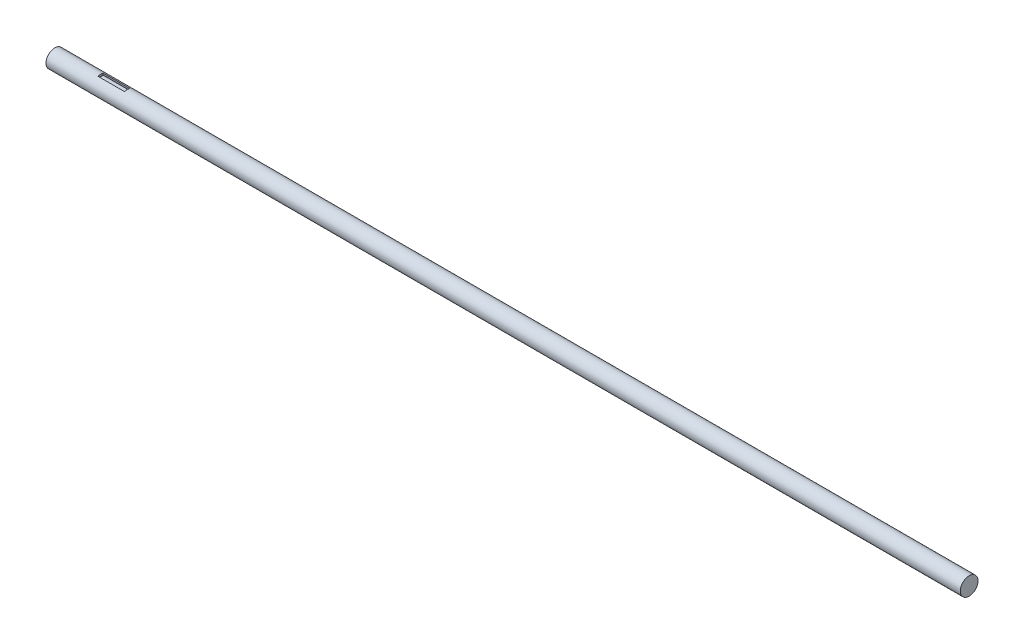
from build123d import *

# Parameters (mm, degrees)
SKETCH1_R           = 30
BOSS_EXTRUDE1_DEPTH = 3100
SKETCH4_W           = 90
SKETCH4_H           = 18
CUT_EXTRUDE1_DEPTH  = 7
FILLET1_R           = 0.6


with BuildPart() as part:
    # Sketch1 → Boss-Extrude1 (new body)
    with BuildSketch(Plane(origin=(0, 0, 0), x_dir=(0, 0, -1), z_dir=(1, 0, 0))):
        Circle(SKETCH1_R)
    extrude(amount=BOSS_EXTRUDE1_DEPTH)

    # Sketch4 → Cut-Extrude1 (cut)
    with BuildSketch(Plane(origin=(0, 30, 0), x_dir=(1, 0, 0), z_dir=(0, 1, 0))):
        with Locations((200, 0)):
            Rectangle(SKETCH4_W, SKETCH4_H)
    extrude(amount=-CUT_EXTRUDE1_DEPTH, mode=Mode.SUBTRACT)

    # Fillet1
    fillet1_edges = [part.edges().sort_by_distance(p)[0] for p in [
        (200, 23, 9),
        (155, 23, 0),
        (245, 23, 0),
        (200, 23, -9),
    ]]
    fillet(fillet1_edges, radius=FILLET1_R)


solid = part.part
